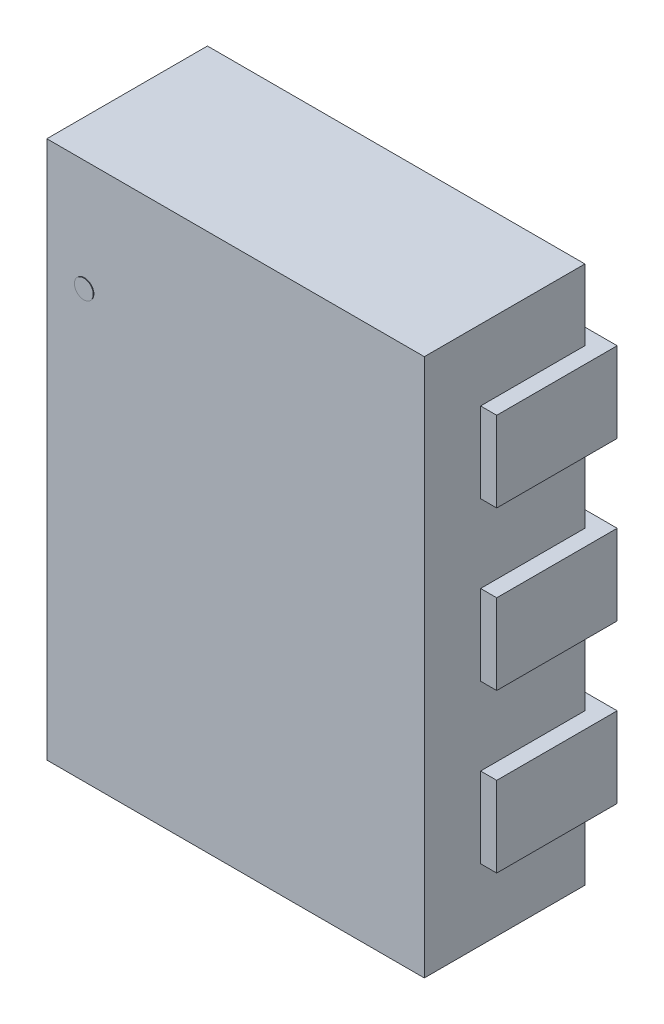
ISO-10303-21;
HEADER;
FILE_DESCRIPTION(('STEP AP214'),'2;1');
FILE_NAME('part.step','',(''),(''),'','','');
FILE_SCHEMA(('AUTOMOTIVE_DESIGN { 1 0 10303 214 1 1 1 1 }'));
ENDSEC;
DATA;
#1=APPLICATION_CONTEXT('core data for automotive mechanical design processes');
#2=APPLICATION_PROTOCOL_DEFINITION('international standard','automotive_design',2000,#1);
#3=PRODUCT_CONTEXT('',#1,'mechanical');
#4=PRODUCT('Part','Part','',(#3));
#5=PRODUCT_RELATED_PRODUCT_CATEGORY('part','',(#4));
#6=PRODUCT_DEFINITION_FORMATION('','',#4);
#7=PRODUCT_DEFINITION_CONTEXT('part definition',#1,'design');
#8=PRODUCT_DEFINITION('design','',#6,#7);
#9=PRODUCT_DEFINITION_SHAPE('','',#8);
#10=(LENGTH_UNIT() NAMED_UNIT(*) SI_UNIT(.MILLI.,.METRE.));
#11=(NAMED_UNIT(*) PLANE_ANGLE_UNIT() SI_UNIT($,.RADIAN.));
#12=(NAMED_UNIT(*) SI_UNIT($,.STERADIAN.) SOLID_ANGLE_UNIT());
#13=UNCERTAINTY_MEASURE_WITH_UNIT(LENGTH_MEASURE(1.E-05),#10,'distance_accuracy_value','');
#14=(GEOMETRIC_REPRESENTATION_CONTEXT(3) GLOBAL_UNCERTAINTY_ASSIGNED_CONTEXT((#13)) GLOBAL_UNIT_ASSIGNED_CONTEXT((#10,
#11,#12)) REPRESENTATION_CONTEXT('',''));
#15=CARTESIAN_POINT('',(0.,0.,0.));
#16=DIRECTION('',(0.,0.,1.));
#17=DIRECTION('',(1.,0.,0.));
#18=AXIS2_PLACEMENT_3D('',#15,#16,#17);
#19=CARTESIAN_POINT('',(-0.478,0.5,0.561));
#20=DIRECTION('',(0.,0.,1.));
#21=DIRECTION('',(1.,0.,0.));
#22=AXIS2_PLACEMENT_3D('',#19,#20,#21);
#23=PLANE('',#22);
#24=CARTESIAN_POINT('',(-0.478,0.5,0.561));
#25=DIRECTION('',(0.,0.,1.));
#26=DIRECTION('',(1.,0.,0.));
#27=AXIS2_PLACEMENT_3D('',#24,#25,#26);
#28=CIRCLE('',#27,0.029845);
#29=CARTESIAN_POINT('',(-0.507,0.5,0.561));
#30=VERTEX_POINT('',#29);
#31=EDGE_CURVE('P0_E44',#30,#30,#28,.T.);
#32=ORIENTED_EDGE('',*,*,#31,.T.);
#33=EDGE_LOOP('',(#32));
#34=FACE_BOUND('',#33,.T.);
#35=ADVANCED_FACE('P0_F17',(#34),#23,.T.);
#36=CARTESIAN_POINT('',(-0.478,0.5,0.559));
#37=DIRECTION('',(0.,0.,1.));
#38=DIRECTION('',(1.,0.,0.));
#39=AXIS2_PLACEMENT_3D('',#36,#37,#38);
#40=PLANE('',#39);
#41=CARTESIAN_POINT('',(-0.478,0.5,0.559));
#42=DIRECTION('',(0.,0.,-1.));
#43=DIRECTION('',(1.,0.,0.));
#44=AXIS2_PLACEMENT_3D('',#41,#42,#43);
#45=CIRCLE('',#44,0.029845);
#46=CARTESIAN_POINT('',(-0.507,0.5,0.559));
#47=VERTEX_POINT('',#46);
#48=EDGE_CURVE('P0_E11',#47,#47,#45,.T.);
#49=ORIENTED_EDGE('',*,*,#48,.T.);
#50=EDGE_LOOP('',(#49));
#51=FACE_BOUND('',#50,.T.);
#52=ADVANCED_FACE('P0_F69',(#51),#40,.F.);
#53=CARTESIAN_POINT('',(-0.478,0.5,0.559));
#54=DIRECTION('',(0.,0.,1.));
#55=DIRECTION('',(1.,0.,0.));
#56=AXIS2_PLACEMENT_3D('',#53,#54,#55);
#57=CYLINDRICAL_SURFACE('',#56,0.029845);
#58=ORIENTED_EDGE('',*,*,#31,.F.);
#59=CARTESIAN_POINT('',(-0.507845,0.5,0.559));
#60=CARTESIAN_POINT('',(-0.507845,0.5,0.561));
#61=(BOUNDED_CURVE() B_SPLINE_CURVE(1,(#59,#60),.UNSPECIFIED.,.F.,
.F.) B_SPLINE_CURVE_WITH_KNOTS((2,2),(0.,0.002),
.UNSPECIFIED.) CURVE() GEOMETRIC_REPRESENTATION_ITEM() RATIONAL_B_SPLINE_CURVE((1.,1.)) REPRESENTATION_ITEM(''));
#62=EDGE_CURVE('P0_E27',#47,#30,#61,.T.);
#63=ORIENTED_EDGE('',*,*,#62,.F.);
#64=ORIENTED_EDGE('',*,*,#48,.F.);
#65=ORIENTED_EDGE('',*,*,#62,.T.);
#66=EDGE_LOOP('',(#58,#63,#64,#65));
#67=FACE_BOUND('',#66,.T.);
#68=ADVANCED_FACE('P0_F43',(#67),#57,.T.);
#69=CLOSED_SHELL('',(#35,#52,#68));
#70=MANIFOLD_SOLID_BREP('P0_B1',#69);
#71=CARTESIAN_POINT('',(-0.597,-0.851,0.559));
#72=DIRECTION('',(0.,0.,1.));
#73=DIRECTION('',(1.,0.,0.));
#74=AXIS2_PLACEMENT_3D('',#71,#72,#73);
#75=PLANE('',#74);
#76=DIRECTION('',(1.,0.,0.));
#77=VECTOR('',#76,1.);
#78=CARTESIAN_POINT('',(-0.597,-0.851,0.559));
#79=LINE('',#78,#77);
#80=CARTESIAN_POINT('',(-0.597,-0.851,0.559));
#81=VERTEX_POINT('',#80);
#82=CARTESIAN_POINT('',(0.597,-0.851,0.559));
#83=VERTEX_POINT('',#82);
#84=EDGE_CURVE('P1_E91',#81,#83,#79,.T.);
#85=ORIENTED_EDGE('',*,*,#84,.T.);
#86=DIRECTION('',(0.,1.,0.));
#87=VECTOR('',#86,1.);
#88=CARTESIAN_POINT('',(0.597,-0.851,0.559));
#89=LINE('',#88,#87);
#90=CARTESIAN_POINT('',(0.597,0.851,0.559));
#91=VERTEX_POINT('',#90);
#92=EDGE_CURVE('P1_E86',#83,#91,#89,.T.);
#93=ORIENTED_EDGE('',*,*,#92,.T.);
#94=DIRECTION('',(-1.,0.,0.));
#95=VECTOR('',#94,1.);
#96=CARTESIAN_POINT('',(0.597,0.851,0.559));
#97=LINE('',#96,#95);
#98=CARTESIAN_POINT('',(-0.597,0.851,0.559));
#99=VERTEX_POINT('',#98);
#100=EDGE_CURVE('P1_E111',#91,#99,#97,.T.);
#101=ORIENTED_EDGE('',*,*,#100,.T.);
#102=DIRECTION('',(0.,-1.,0.));
#103=VECTOR('',#102,1.);
#104=CARTESIAN_POINT('',(-0.597,0.851,0.559));
#105=LINE('',#104,#103);
#106=EDGE_CURVE('P1_E11',#99,#81,#105,.T.);
#107=ORIENTED_EDGE('',*,*,#106,.T.);
#108=EDGE_LOOP('',(#85,#93,#101,#107));
#109=FACE_BOUND('',#108,.T.);
#110=ADVANCED_FACE('P1_F17',(#109),#75,.T.);
#111=CARTESIAN_POINT('',(-0.597,0.851,0.051));
#112=DIRECTION('',(0.,0.,-1.));
#113=DIRECTION('',(0.,-1.,0.));
#114=AXIS2_PLACEMENT_3D('',#111,#112,#113);
#115=PLANE('',#114);
#116=DIRECTION('',(1.,0.,0.));
#117=VECTOR('',#116,1.);
#118=CARTESIAN_POINT('',(-0.597,0.851,0.051));
#119=LINE('',#118,#117);
#120=CARTESIAN_POINT('',(-0.597,0.851,0.051));
#121=VERTEX_POINT('',#120);
#122=CARTESIAN_POINT('',(0.597,0.851,0.051));
#123=VERTEX_POINT('',#122);
#124=EDGE_CURVE('P1_E74',#121,#123,#119,.T.);
#125=ORIENTED_EDGE('',*,*,#124,.T.);
#126=DIRECTION('',(0.,-1.,0.));
#127=VECTOR('',#126,1.);
#128=CARTESIAN_POINT('',(0.597,0.851,0.051));
#129=LINE('',#128,#127);
#130=CARTESIAN_POINT('',(0.597,-0.851,0.051));
#131=VERTEX_POINT('',#130);
#132=EDGE_CURVE('P1_E68',#123,#131,#129,.T.);
#133=ORIENTED_EDGE('',*,*,#132,.T.);
#134=DIRECTION('',(-1.,0.,0.));
#135=VECTOR('',#134,1.);
#136=CARTESIAN_POINT('',(0.597,-0.851,0.051));
#137=LINE('',#136,#135);
#138=CARTESIAN_POINT('',(-0.597,-0.851,0.051));
#139=VERTEX_POINT('',#138);
#140=EDGE_CURVE('P1_E72',#131,#139,#137,.T.);
#141=ORIENTED_EDGE('',*,*,#140,.T.);
#142=DIRECTION('',(0.,1.,0.));
#143=VECTOR('',#142,1.);
#144=CARTESIAN_POINT('',(-0.597,-0.851,0.051));
#145=LINE('',#144,#143);
#146=EDGE_CURVE('P1_E20',#139,#121,#145,.T.);
#147=ORIENTED_EDGE('',*,*,#146,.T.);
#148=EDGE_LOOP('',(#125,#133,#141,#147));
#149=FACE_BOUND('',#148,.T.);
#150=ADVANCED_FACE('P1_F70',(#149),#115,.T.);
#151=CARTESIAN_POINT('',(-0.597,0.851,0.051));
#152=DIRECTION('',(-1.,0.,0.));
#153=DIRECTION('',(0.,0.,1.));
#154=AXIS2_PLACEMENT_3D('',#151,#152,#153);
#155=PLANE('',#154);
#156=ORIENTED_EDGE('',*,*,#146,.F.);
#157=DIRECTION('',(0.,0.,1.));
#158=VECTOR('',#157,1.);
#159=CARTESIAN_POINT('',(-0.597,-0.851,0.051));
#160=LINE('',#159,#158);
#161=EDGE_CURVE('P1_E80',#139,#81,#160,.T.);
#162=ORIENTED_EDGE('',*,*,#161,.T.);
#163=ORIENTED_EDGE('',*,*,#106,.F.);
#164=DIRECTION('',(0.,0.,-1.));
#165=VECTOR('',#164,1.);
#166=CARTESIAN_POINT('',(-0.597,0.851,0.559));
#167=LINE('',#166,#165);
#168=EDGE_CURVE('P1_E109',#99,#121,#167,.T.);
#169=ORIENTED_EDGE('',*,*,#168,.T.);
#170=EDGE_LOOP('',(#156,#162,#163,#169));
#171=FACE_BOUND('',#170,.T.);
#172=ADVANCED_FACE('P1_F148',(#171),#155,.T.);
#173=CARTESIAN_POINT('',(0.597,0.851,0.051));
#174=DIRECTION('',(0.,1.,0.));
#175=DIRECTION('',(1.,0.,0.));
#176=AXIS2_PLACEMENT_3D('',#173,#174,#175);
#177=PLANE('',#176);
#178=ORIENTED_EDGE('',*,*,#124,.F.);
#179=ORIENTED_EDGE('',*,*,#168,.F.);
#180=ORIENTED_EDGE('',*,*,#100,.F.);
#181=DIRECTION('',(0.,0.,-1.));
#182=VECTOR('',#181,1.);
#183=CARTESIAN_POINT('',(0.597,0.851,0.559));
#184=LINE('',#183,#182);
#185=EDGE_CURVE('P1_E79',#91,#123,#184,.T.);
#186=ORIENTED_EDGE('',*,*,#185,.T.);
#187=EDGE_LOOP('',(#178,#179,#180,#186));
#188=FACE_BOUND('',#187,.T.);
#189=ADVANCED_FACE('P1_F138',(#188),#177,.T.);
#190=CARTESIAN_POINT('',(0.597,-0.851,0.051));
#191=DIRECTION('',(1.,0.,0.));
#192=DIRECTION('',(0.,1.,0.));
#193=AXIS2_PLACEMENT_3D('',#190,#191,#192);
#194=PLANE('',#193);
#195=ORIENTED_EDGE('',*,*,#132,.F.);
#196=ORIENTED_EDGE('',*,*,#185,.F.);
#197=ORIENTED_EDGE('',*,*,#92,.F.);
#198=DIRECTION('',(0.,0.,-1.));
#199=VECTOR('',#198,1.);
#200=CARTESIAN_POINT('',(0.597,-0.851,0.559));
#201=LINE('',#200,#199);
#202=EDGE_CURVE('P1_E83',#83,#131,#201,.T.);
#203=ORIENTED_EDGE('',*,*,#202,.T.);
#204=EDGE_LOOP('',(#195,#196,#197,#203));
#205=FACE_BOUND('',#204,.T.);
#206=ADVANCED_FACE('P1_F84',(#205),#194,.T.);
#207=CARTESIAN_POINT('',(-0.597,-0.851,0.051));
#208=DIRECTION('',(0.,-1.,0.));
#209=DIRECTION('',(0.,0.,-1.));
#210=AXIS2_PLACEMENT_3D('',#207,#208,#209);
#211=PLANE('',#210);
#212=ORIENTED_EDGE('',*,*,#140,.F.);
#213=ORIENTED_EDGE('',*,*,#202,.F.);
#214=ORIENTED_EDGE('',*,*,#84,.F.);
#215=ORIENTED_EDGE('',*,*,#161,.F.);
#216=EDGE_LOOP('',(#212,#213,#214,#215));
#217=FACE_BOUND('',#216,.T.);
#218=ADVANCED_FACE('P1_F94',(#217),#211,.T.);
#219=CLOSED_SHELL('',(#110,#150,#172,#189,#206,#218));
#220=MANIFOLD_SOLID_BREP('P1_B1',#219);
#221=CARTESIAN_POINT('',(0.648,-0.627,0.));
#222=DIRECTION('',(0.,0.,-1.));
#223=DIRECTION('',(0.,-1.,0.));
#224=AXIS2_PLACEMENT_3D('',#221,#222,#223);
#225=PLANE('',#224);
#226=DIRECTION('',(-1.,0.,0.));
#227=VECTOR('',#226,1.);
#228=CARTESIAN_POINT('',(0.648,-0.627,0.));
#229=LINE('',#228,#227);
#230=CARTESIAN_POINT('',(0.648,-0.627,0.));
#231=VERTEX_POINT('',#230);
#232=CARTESIAN_POINT('',(0.244,-0.627,0.));
#233=VERTEX_POINT('',#232);
#234=EDGE_CURVE('P2_E110',#231,#233,#229,.T.);
#235=ORIENTED_EDGE('',*,*,#234,.T.);
#236=DIRECTION('',(0.,1.,0.));
#237=VECTOR('',#236,1.);
#238=CARTESIAN_POINT('',(0.244,-0.627,0.));
#239=LINE('',#238,#237);
#240=CARTESIAN_POINT('',(0.244,-0.373,0.));
#241=VERTEX_POINT('',#240);
#242=EDGE_CURVE('P2_E11',#233,#241,#239,.T.);
#243=ORIENTED_EDGE('',*,*,#242,.T.);
#244=DIRECTION('',(1.,0.,0.));
#245=VECTOR('',#244,1.);
#246=CARTESIAN_POINT('',(0.244,-0.373,0.));
#247=LINE('',#246,#245);
#248=CARTESIAN_POINT('',(0.648,-0.373,0.));
#249=VERTEX_POINT('',#248);
#250=EDGE_CURVE('P2_E137',#241,#249,#247,.T.);
#251=ORIENTED_EDGE('',*,*,#250,.T.);
#252=DIRECTION('',(0.,-1.,0.));
#253=VECTOR('',#252,1.);
#254=CARTESIAN_POINT('',(0.648,-0.373,0.));
#255=LINE('',#254,#253);
#256=EDGE_CURVE('P2_E26',#249,#231,#255,.T.);
#257=ORIENTED_EDGE('',*,*,#256,.T.);
#258=EDGE_LOOP('',(#235,#243,#251,#257));
#259=FACE_BOUND('',#258,.T.);
#260=ADVANCED_FACE('P2_F17',(#259),#225,.T.);
#261=CARTESIAN_POINT('',(0.597,-0.373,0.051));
#262=DIRECTION('',(-1.,0.,0.));
#263=DIRECTION('',(0.,0.,1.));
#264=AXIS2_PLACEMENT_3D('',#261,#262,#263);
#265=PLANE('',#264);
#266=DIRECTION('',(0.,-1.,0.));
#267=VECTOR('',#266,1.);
#268=CARTESIAN_POINT('',(0.597,-0.373,0.051));
#269=LINE('',#268,#267);
#270=CARTESIAN_POINT('',(0.597,-0.373,0.051));
#271=VERTEX_POINT('',#270);
#272=CARTESIAN_POINT('',(0.597,-0.627,0.051));
#273=VERTEX_POINT('',#272);
#274=EDGE_CURVE('P2_E94',#271,#273,#269,.T.);
#275=ORIENTED_EDGE('',*,*,#274,.T.);
#276=DIRECTION('',(0.,0.,1.));
#277=VECTOR('',#276,1.);
#278=CARTESIAN_POINT('',(0.597,-0.627,0.051));
#279=LINE('',#278,#277);
#280=CARTESIAN_POINT('',(0.597,-0.627,0.381));
#281=VERTEX_POINT('',#280);
#282=EDGE_CURVE('P2_E92',#273,#281,#279,.T.);
#283=ORIENTED_EDGE('',*,*,#282,.T.);
#284=DIRECTION('',(0.,1.,0.));
#285=VECTOR('',#284,1.);
#286=CARTESIAN_POINT('',(0.597,-0.627,0.381));
#287=LINE('',#286,#285);
#288=CARTESIAN_POINT('',(0.597,-0.373,0.381));
#289=VERTEX_POINT('',#288);
#290=EDGE_CURVE('P2_E76',#281,#289,#287,.T.);
#291=ORIENTED_EDGE('',*,*,#290,.T.);
#292=DIRECTION('',(0.,0.,-1.));
#293=VECTOR('',#292,1.);
#294=CARTESIAN_POINT('',(0.597,-0.373,0.381));
#295=LINE('',#294,#293);
#296=EDGE_CURVE('P2_E115',#289,#271,#295,.T.);
#297=ORIENTED_EDGE('',*,*,#296,.T.);
#298=EDGE_LOOP('',(#275,#283,#291,#297));
#299=FACE_BOUND('',#298,.T.);
#300=ADVANCED_FACE('P2_F93',(#299),#265,.T.);
#301=CARTESIAN_POINT('',(0.244,-0.373,0.));
#302=DIRECTION('',(-1.,0.,0.));
#303=DIRECTION('',(0.,0.,1.));
#304=AXIS2_PLACEMENT_3D('',#301,#302,#303);
#305=PLANE('',#304);
#306=ORIENTED_EDGE('',*,*,#242,.F.);
#307=DIRECTION('',(0.,0.,1.));
#308=VECTOR('',#307,1.);
#309=CARTESIAN_POINT('',(0.244,-0.627,0.));
#310=LINE('',#309,#308);
#311=CARTESIAN_POINT('',(0.244,-0.627,0.051));
#312=VERTEX_POINT('',#311);
#313=EDGE_CURVE('P2_E89',#233,#312,#310,.T.);
#314=ORIENTED_EDGE('',*,*,#313,.T.);
#315=DIRECTION('',(0.,1.,0.));
#316=VECTOR('',#315,1.);
#317=CARTESIAN_POINT('',(0.244,-0.627,0.051));
#318=LINE('',#317,#316);
#319=CARTESIAN_POINT('',(0.244,-0.373,0.051));
#320=VERTEX_POINT('',#319);
#321=EDGE_CURVE('P2_E38',#312,#320,#318,.T.);
#322=ORIENTED_EDGE('',*,*,#321,.T.);
#323=DIRECTION('',(0.,0.,-1.));
#324=VECTOR('',#323,1.);
#325=CARTESIAN_POINT('',(0.244,-0.373,0.051));
#326=LINE('',#325,#324);
#327=EDGE_CURVE('P2_E150',#320,#241,#326,.T.);
#328=ORIENTED_EDGE('',*,*,#327,.T.);
#329=EDGE_LOOP('',(#306,#314,#322,#328));
#330=FACE_BOUND('',#329,.T.);
#331=ADVANCED_FACE('P2_F161',(#330),#305,.T.);
#332=CARTESIAN_POINT('',(0.648,-0.627,0.));
#333=DIRECTION('',(1.,0.,0.));
#334=DIRECTION('',(0.,1.,0.));
#335=AXIS2_PLACEMENT_3D('',#332,#333,#334);
#336=PLANE('',#335);
#337=ORIENTED_EDGE('',*,*,#256,.F.);
#338=DIRECTION('',(0.,0.,1.));
#339=VECTOR('',#338,1.);
#340=CARTESIAN_POINT('',(0.648,-0.373,0.));
#341=LINE('',#340,#339);
#342=CARTESIAN_POINT('',(0.648,-0.373,0.381));
#343=VERTEX_POINT('',#342);
#344=EDGE_CURVE('P2_E119',#249,#343,#341,.T.);
#345=ORIENTED_EDGE('',*,*,#344,.T.);
#346=DIRECTION('',(0.,-1.,0.));
#347=VECTOR('',#346,1.);
#348=CARTESIAN_POINT('',(0.648,-0.373,0.381));
#349=LINE('',#348,#347);
#350=CARTESIAN_POINT('',(0.648,-0.627,0.381));
#351=VERTEX_POINT('',#350);
#352=EDGE_CURVE('P2_E88',#343,#351,#349,.T.);
#353=ORIENTED_EDGE('',*,*,#352,.T.);
#354=DIRECTION('',(0.,0.,-1.));
#355=VECTOR('',#354,1.);
#356=CARTESIAN_POINT('',(0.648,-0.627,0.381));
#357=LINE('',#356,#355);
#358=EDGE_CURVE('P2_E103',#351,#231,#357,.T.);
#359=ORIENTED_EDGE('',*,*,#358,.T.);
#360=EDGE_LOOP('',(#337,#345,#353,#359));
#361=FACE_BOUND('',#360,.T.);
#362=ADVANCED_FACE('P2_F140',(#361),#336,.T.);
#363=CARTESIAN_POINT('',(0.597,-0.373,0.051));
#364=DIRECTION('',(0.,0.,1.));
#365=DIRECTION('',(1.,0.,0.));
#366=AXIS2_PLACEMENT_3D('',#363,#364,#365);
#367=PLANE('',#366);
#368=DIRECTION('',(-1.,0.,0.));
#369=VECTOR('',#368,1.);
#370=CARTESIAN_POINT('',(0.597,-0.373,0.051));
#371=LINE('',#370,#369);
#372=EDGE_CURVE('P2_E114',#271,#320,#371,.T.);
#373=ORIENTED_EDGE('',*,*,#372,.T.);
#374=ORIENTED_EDGE('',*,*,#321,.F.);
#375=DIRECTION('',(1.,0.,0.));
#376=VECTOR('',#375,1.);
#377=CARTESIAN_POINT('',(0.244,-0.627,0.051));
#378=LINE('',#377,#376);
#379=EDGE_CURVE('P2_E98',#312,#273,#378,.T.);
#380=ORIENTED_EDGE('',*,*,#379,.T.);
#381=ORIENTED_EDGE('',*,*,#274,.F.);
#382=EDGE_LOOP('',(#373,#374,#380,#381));
#383=FACE_BOUND('',#382,.T.);
#384=ADVANCED_FACE('P2_F162',(#383),#367,.T.);
#385=CARTESIAN_POINT('',(0.648,-0.373,0.381));
#386=DIRECTION('',(0.,0.,1.));
#387=DIRECTION('',(1.,0.,0.));
#388=AXIS2_PLACEMENT_3D('',#385,#386,#387);
#389=PLANE('',#388);
#390=DIRECTION('',(-1.,0.,0.));
#391=VECTOR('',#390,1.);
#392=CARTESIAN_POINT('',(0.648,-0.373,0.381));
#393=LINE('',#392,#391);
#394=EDGE_CURVE('P2_E83',#343,#289,#393,.T.);
#395=ORIENTED_EDGE('',*,*,#394,.T.);
#396=ORIENTED_EDGE('',*,*,#290,.F.);
#397=DIRECTION('',(1.,0.,0.));
#398=VECTOR('',#397,1.);
#399=CARTESIAN_POINT('',(0.597,-0.627,0.381));
#400=LINE('',#399,#398);
#401=EDGE_CURVE('P2_E80',#281,#351,#400,.T.);
#402=ORIENTED_EDGE('',*,*,#401,.T.);
#403=ORIENTED_EDGE('',*,*,#352,.F.);
#404=EDGE_LOOP('',(#395,#396,#402,#403));
#405=FACE_BOUND('',#404,.T.);
#406=ADVANCED_FACE('P2_F78',(#405),#389,.T.);
#407=CARTESIAN_POINT('',(0.244,-0.627,0.));
#408=DIRECTION('',(0.,-1.,0.));
#409=DIRECTION('',(0.,0.,-1.));
#410=AXIS2_PLACEMENT_3D('',#407,#408,#409);
#411=PLANE('',#410);
#412=ORIENTED_EDGE('',*,*,#234,.F.);
#413=ORIENTED_EDGE('',*,*,#358,.F.);
#414=ORIENTED_EDGE('',*,*,#401,.F.);
#415=ORIENTED_EDGE('',*,*,#282,.F.);
#416=ORIENTED_EDGE('',*,*,#379,.F.);
#417=ORIENTED_EDGE('',*,*,#313,.F.);
#418=EDGE_LOOP('',(#412,#413,#414,#415,#416,#417));
#419=FACE_BOUND('',#418,.T.);
#420=ADVANCED_FACE('P2_F101',(#419),#411,.T.);
#421=CARTESIAN_POINT('',(0.648,-0.373,0.));
#422=DIRECTION('',(0.,1.,0.));
#423=DIRECTION('',(1.,0.,0.));
#424=AXIS2_PLACEMENT_3D('',#421,#422,#423);
#425=PLANE('',#424);
#426=ORIENTED_EDGE('',*,*,#250,.F.);
#427=ORIENTED_EDGE('',*,*,#327,.F.);
#428=ORIENTED_EDGE('',*,*,#372,.F.);
#429=ORIENTED_EDGE('',*,*,#296,.F.);
#430=ORIENTED_EDGE('',*,*,#394,.F.);
#431=ORIENTED_EDGE('',*,*,#344,.F.);
#432=EDGE_LOOP('',(#426,#427,#428,#429,#430,#431));
#433=FACE_BOUND('',#432,.T.);
#434=ADVANCED_FACE('P2_F165',(#433),#425,.T.);
#435=CLOSED_SHELL('',(#260,#300,#331,#362,#384,#406,#420,#434));
#436=MANIFOLD_SOLID_BREP('P2_B1',#435);
#437=CARTESIAN_POINT('',(0.648,-0.127,0.));
#438=DIRECTION('',(0.,0.,-1.));
#439=DIRECTION('',(0.,-1.,0.));
#440=AXIS2_PLACEMENT_3D('',#437,#438,#439);
#441=PLANE('',#440);
#442=DIRECTION('',(-1.,0.,0.));
#443=VECTOR('',#442,1.);
#444=CARTESIAN_POINT('',(0.648,-0.127,0.));
#445=LINE('',#444,#443);
#446=CARTESIAN_POINT('',(0.648,-0.127,0.));
#447=VERTEX_POINT('',#446);
#448=CARTESIAN_POINT('',(0.244,-0.127,0.));
#449=VERTEX_POINT('',#448);
#450=EDGE_CURVE('P3_E93',#447,#449,#445,.T.);
#451=ORIENTED_EDGE('',*,*,#450,.T.);
#452=DIRECTION('',(0.,1.,0.));
#453=VECTOR('',#452,1.);
#454=CARTESIAN_POINT('',(0.244,-0.127,0.));
#455=LINE('',#454,#453);
#456=CARTESIAN_POINT('',(0.244,0.127,0.));
#457=VERTEX_POINT('',#456);
#458=EDGE_CURVE('P3_E11',#449,#457,#455,.T.);
#459=ORIENTED_EDGE('',*,*,#458,.T.);
#460=DIRECTION('',(1.,0.,0.));
#461=VECTOR('',#460,1.);
#462=CARTESIAN_POINT('',(0.244,0.127,0.));
#463=LINE('',#462,#461);
#464=CARTESIAN_POINT('',(0.648,0.127,0.));
#465=VERTEX_POINT('',#464);
#466=EDGE_CURVE('P3_E91',#457,#465,#463,.T.);
#467=ORIENTED_EDGE('',*,*,#466,.T.);
#468=DIRECTION('',(0.,-1.,0.));
#469=VECTOR('',#468,1.);
#470=CARTESIAN_POINT('',(0.648,0.127,0.));
#471=LINE('',#470,#469);
#472=EDGE_CURVE('P3_E26',#465,#447,#471,.T.);
#473=ORIENTED_EDGE('',*,*,#472,.T.);
#474=EDGE_LOOP('',(#451,#459,#467,#473));
#475=FACE_BOUND('',#474,.T.);
#476=ADVANCED_FACE('P3_F17',(#475),#441,.T.);
#477=CARTESIAN_POINT('',(0.597,0.127,0.051));
#478=DIRECTION('',(-1.,0.,0.));
#479=DIRECTION('',(0.,0.,1.));
#480=AXIS2_PLACEMENT_3D('',#477,#478,#479);
#481=PLANE('',#480);
#482=DIRECTION('',(0.,-1.,0.));
#483=VECTOR('',#482,1.);
#484=CARTESIAN_POINT('',(0.597,0.127,0.051));
#485=LINE('',#484,#483);
#486=CARTESIAN_POINT('',(0.597,0.127,0.051));
#487=VERTEX_POINT('',#486);
#488=CARTESIAN_POINT('',(0.597,-0.127,0.051));
#489=VERTEX_POINT('',#488);
#490=EDGE_CURVE('P3_E48',#487,#489,#485,.T.);
#491=ORIENTED_EDGE('',*,*,#490,.T.);
#492=DIRECTION('',(0.,0.,1.));
#493=VECTOR('',#492,1.);
#494=CARTESIAN_POINT('',(0.597,-0.127,0.051));
#495=LINE('',#494,#493);
#496=CARTESIAN_POINT('',(0.597,-0.127,0.381));
#497=VERTEX_POINT('',#496);
#498=EDGE_CURVE('P3_E134',#489,#497,#495,.T.);
#499=ORIENTED_EDGE('',*,*,#498,.T.);
#500=DIRECTION('',(0.,1.,0.));
#501=VECTOR('',#500,1.);
#502=CARTESIAN_POINT('',(0.597,-0.127,0.381));
#503=LINE('',#502,#501);
#504=CARTESIAN_POINT('',(0.597,0.127,0.381));
#505=VERTEX_POINT('',#504);
#506=EDGE_CURVE('P3_E118',#497,#505,#503,.T.);
#507=ORIENTED_EDGE('',*,*,#506,.T.);
#508=DIRECTION('',(0.,0.,-1.));
#509=VECTOR('',#508,1.);
#510=CARTESIAN_POINT('',(0.597,0.127,0.381));
#511=LINE('',#510,#509);
#512=EDGE_CURVE('P3_E127',#505,#487,#511,.T.);
#513=ORIENTED_EDGE('',*,*,#512,.T.);
#514=EDGE_LOOP('',(#491,#499,#507,#513));
#515=FACE_BOUND('',#514,.T.);
#516=ADVANCED_FACE('P3_F19',(#515),#481,.T.);
#517=CARTESIAN_POINT('',(0.244,0.127,0.));
#518=DIRECTION('',(-1.,0.,0.));
#519=DIRECTION('',(0.,0.,1.));
#520=AXIS2_PLACEMENT_3D('',#517,#518,#519);
#521=PLANE('',#520);
#522=ORIENTED_EDGE('',*,*,#458,.F.);
#523=DIRECTION('',(0.,0.,1.));
#524=VECTOR('',#523,1.);
#525=CARTESIAN_POINT('',(0.244,-0.127,0.));
#526=LINE('',#525,#524);
#527=CARTESIAN_POINT('',(0.244,-0.127,0.051));
#528=VERTEX_POINT('',#527);
#529=EDGE_CURVE('P3_E115',#449,#528,#526,.T.);
#530=ORIENTED_EDGE('',*,*,#529,.T.);
#531=DIRECTION('',(0.,1.,0.));
#532=VECTOR('',#531,1.);
#533=CARTESIAN_POINT('',(0.244,-0.127,0.051));
#534=LINE('',#533,#532);
#535=CARTESIAN_POINT('',(0.244,0.127,0.051));
#536=VERTEX_POINT('',#535);
#537=EDGE_CURVE('P3_E38',#528,#536,#534,.T.);
#538=ORIENTED_EDGE('',*,*,#537,.T.);
#539=DIRECTION('',(0.,0.,-1.));
#540=VECTOR('',#539,1.);
#541=CARTESIAN_POINT('',(0.244,0.127,0.051));
#542=LINE('',#541,#540);
#543=EDGE_CURVE('P3_E97',#536,#457,#542,.T.);
#544=ORIENTED_EDGE('',*,*,#543,.T.);
#545=EDGE_LOOP('',(#522,#530,#538,#544));
#546=FACE_BOUND('',#545,.T.);
#547=ADVANCED_FACE('P3_F98',(#546),#521,.T.);
#548=CARTESIAN_POINT('',(0.648,-0.127,0.));
#549=DIRECTION('',(1.,0.,0.));
#550=DIRECTION('',(0.,1.,0.));
#551=AXIS2_PLACEMENT_3D('',#548,#549,#550);
#552=PLANE('',#551);
#553=ORIENTED_EDGE('',*,*,#472,.F.);
#554=DIRECTION('',(0.,0.,1.));
#555=VECTOR('',#554,1.);
#556=CARTESIAN_POINT('',(0.648,0.127,0.));
#557=LINE('',#556,#555);
#558=CARTESIAN_POINT('',(0.648,0.127,0.381));
#559=VERTEX_POINT('',#558);
#560=EDGE_CURVE('P3_E108',#465,#559,#557,.T.);
#561=ORIENTED_EDGE('',*,*,#560,.T.);
#562=DIRECTION('',(0.,-1.,0.));
#563=VECTOR('',#562,1.);
#564=CARTESIAN_POINT('',(0.648,0.127,0.381));
#565=LINE('',#564,#563);
#566=CARTESIAN_POINT('',(0.648,-0.127,0.381));
#567=VERTEX_POINT('',#566);
#568=EDGE_CURVE('P3_E140',#559,#567,#565,.T.);
#569=ORIENTED_EDGE('',*,*,#568,.T.);
#570=DIRECTION('',(0.,0.,-1.));
#571=VECTOR('',#570,1.);
#572=CARTESIAN_POINT('',(0.648,-0.127,0.381));
#573=LINE('',#572,#571);
#574=EDGE_CURVE('P3_E120',#567,#447,#573,.T.);
#575=ORIENTED_EDGE('',*,*,#574,.T.);
#576=EDGE_LOOP('',(#553,#561,#569,#575));
#577=FACE_BOUND('',#576,.T.);
#578=ADVANCED_FACE('P3_F156',(#577),#552,.T.);
#579=CARTESIAN_POINT('',(0.597,0.127,0.051));
#580=DIRECTION('',(0.,0.,1.));
#581=DIRECTION('',(1.,0.,0.));
#582=AXIS2_PLACEMENT_3D('',#579,#580,#581);
#583=PLANE('',#582);
#584=DIRECTION('',(-1.,0.,0.));
#585=VECTOR('',#584,1.);
#586=CARTESIAN_POINT('',(0.597,0.127,0.051));
#587=LINE('',#586,#585);
#588=EDGE_CURVE('P3_E102',#487,#536,#587,.T.);
#589=ORIENTED_EDGE('',*,*,#588,.T.);
#590=ORIENTED_EDGE('',*,*,#537,.F.);
#591=DIRECTION('',(1.,0.,0.));
#592=VECTOR('',#591,1.);
#593=CARTESIAN_POINT('',(0.244,-0.127,0.051));
#594=LINE('',#593,#592);
#595=EDGE_CURVE('P3_E119',#528,#489,#594,.T.);
#596=ORIENTED_EDGE('',*,*,#595,.T.);
#597=ORIENTED_EDGE('',*,*,#490,.F.);
#598=EDGE_LOOP('',(#589,#590,#596,#597));
#599=FACE_BOUND('',#598,.T.);
#600=ADVANCED_FACE('P3_F162',(#599),#583,.T.);
#601=CARTESIAN_POINT('',(0.648,0.127,0.381));
#602=DIRECTION('',(0.,0.,1.));
#603=DIRECTION('',(1.,0.,0.));
#604=AXIS2_PLACEMENT_3D('',#601,#602,#603);
#605=PLANE('',#604);
#606=DIRECTION('',(-1.,0.,0.));
#607=VECTOR('',#606,1.);
#608=CARTESIAN_POINT('',(0.648,0.127,0.381));
#609=LINE('',#608,#607);
#610=EDGE_CURVE('P3_E130',#559,#505,#609,.T.);
#611=ORIENTED_EDGE('',*,*,#610,.T.);
#612=ORIENTED_EDGE('',*,*,#506,.F.);
#613=DIRECTION('',(1.,0.,0.));
#614=VECTOR('',#613,1.);
#615=CARTESIAN_POINT('',(0.597,-0.127,0.381));
#616=LINE('',#615,#614);
#617=EDGE_CURVE('P3_E124',#497,#567,#616,.T.);
#618=ORIENTED_EDGE('',*,*,#617,.T.);
#619=ORIENTED_EDGE('',*,*,#568,.F.);
#620=EDGE_LOOP('',(#611,#612,#618,#619));
#621=FACE_BOUND('',#620,.T.);
#622=ADVANCED_FACE('P3_F165',(#621),#605,.T.);
#623=CARTESIAN_POINT('',(0.244,-0.127,0.));
#624=DIRECTION('',(0.,-1.,0.));
#625=DIRECTION('',(0.,0.,-1.));
#626=AXIS2_PLACEMENT_3D('',#623,#624,#625);
#627=PLANE('',#626);
#628=ORIENTED_EDGE('',*,*,#450,.F.);
#629=ORIENTED_EDGE('',*,*,#574,.F.);
#630=ORIENTED_EDGE('',*,*,#617,.F.);
#631=ORIENTED_EDGE('',*,*,#498,.F.);
#632=ORIENTED_EDGE('',*,*,#595,.F.);
#633=ORIENTED_EDGE('',*,*,#529,.F.);
#634=EDGE_LOOP('',(#628,#629,#630,#631,#632,#633));
#635=FACE_BOUND('',#634,.T.);
#636=ADVANCED_FACE('P3_F159',(#635),#627,.T.);
#637=CARTESIAN_POINT('',(0.648,0.127,0.));
#638=DIRECTION('',(0.,1.,0.));
#639=DIRECTION('',(1.,0.,0.));
#640=AXIS2_PLACEMENT_3D('',#637,#638,#639);
#641=PLANE('',#640);
#642=ORIENTED_EDGE('',*,*,#466,.F.);
#643=ORIENTED_EDGE('',*,*,#543,.F.);
#644=ORIENTED_EDGE('',*,*,#588,.F.);
#645=ORIENTED_EDGE('',*,*,#512,.F.);
#646=ORIENTED_EDGE('',*,*,#610,.F.);
#647=ORIENTED_EDGE('',*,*,#560,.F.);
#648=EDGE_LOOP('',(#642,#643,#644,#645,#646,#647));
#649=FACE_BOUND('',#648,.T.);
#650=ADVANCED_FACE('P3_F105',(#649),#641,.T.);
#651=CLOSED_SHELL('',(#476,#516,#547,#578,#600,#622,#636,#650));
#652=MANIFOLD_SOLID_BREP('P3_B1',#651);
#653=CARTESIAN_POINT('',(0.648,0.373,0.));
#654=DIRECTION('',(0.,0.,-1.));
#655=DIRECTION('',(0.,-1.,0.));
#656=AXIS2_PLACEMENT_3D('',#653,#654,#655);
#657=PLANE('',#656);
#658=DIRECTION('',(-1.,0.,0.));
#659=VECTOR('',#658,1.);
#660=CARTESIAN_POINT('',(0.648,0.373,0.));
#661=LINE('',#660,#659);
#662=CARTESIAN_POINT('',(0.648,0.373,0.));
#663=VERTEX_POINT('',#662);
#664=CARTESIAN_POINT('',(0.244,0.373,0.));
#665=VERTEX_POINT('',#664);
#666=EDGE_CURVE('P4_E117',#663,#665,#661,.T.);
#667=ORIENTED_EDGE('',*,*,#666,.T.);
#668=DIRECTION('',(0.,1.,0.));
#669=VECTOR('',#668,1.);
#670=CARTESIAN_POINT('',(0.244,0.373,0.));
#671=LINE('',#670,#669);
#672=CARTESIAN_POINT('',(0.244,0.627,0.));
#673=VERTEX_POINT('',#672);
#674=EDGE_CURVE('P4_E11',#665,#673,#671,.T.);
#675=ORIENTED_EDGE('',*,*,#674,.T.);
#676=DIRECTION('',(1.,0.,0.));
#677=VECTOR('',#676,1.);
#678=CARTESIAN_POINT('',(0.244,0.627,0.));
#679=LINE('',#678,#677);
#680=CARTESIAN_POINT('',(0.648,0.627,0.));
#681=VERTEX_POINT('',#680);
#682=EDGE_CURVE('P4_E113',#673,#681,#679,.T.);
#683=ORIENTED_EDGE('',*,*,#682,.T.);
#684=DIRECTION('',(0.,-1.,0.));
#685=VECTOR('',#684,1.);
#686=CARTESIAN_POINT('',(0.648,0.627,0.));
#687=LINE('',#686,#685);
#688=EDGE_CURVE('P4_E26',#681,#663,#687,.T.);
#689=ORIENTED_EDGE('',*,*,#688,.T.);
#690=EDGE_LOOP('',(#667,#675,#683,#689));
#691=FACE_BOUND('',#690,.T.);
#692=ADVANCED_FACE('P4_F17',(#691),#657,.T.);
#693=CARTESIAN_POINT('',(0.597,0.627,0.051));
#694=DIRECTION('',(-1.,0.,0.));
#695=DIRECTION('',(0.,0.,1.));
#696=AXIS2_PLACEMENT_3D('',#693,#694,#695);
#697=PLANE('',#696);
#698=DIRECTION('',(0.,-1.,0.));
#699=VECTOR('',#698,1.);
#700=CARTESIAN_POINT('',(0.597,0.627,0.051));
#701=LINE('',#700,#699);
#702=CARTESIAN_POINT('',(0.597,0.627,0.051));
#703=VERTEX_POINT('',#702);
#704=CARTESIAN_POINT('',(0.597,0.373,0.051));
#705=VERTEX_POINT('',#704);
#706=EDGE_CURVE('P4_E48',#703,#705,#701,.T.);
#707=ORIENTED_EDGE('',*,*,#706,.T.);
#708=DIRECTION('',(0.,0.,1.));
#709=VECTOR('',#708,1.);
#710=CARTESIAN_POINT('',(0.597,0.373,0.051));
#711=LINE('',#710,#709);
#712=CARTESIAN_POINT('',(0.597,0.373,0.381));
#713=VERTEX_POINT('',#712);
#714=EDGE_CURVE('P4_E136',#705,#713,#711,.T.);
#715=ORIENTED_EDGE('',*,*,#714,.T.);
#716=DIRECTION('',(0.,1.,0.));
#717=VECTOR('',#716,1.);
#718=CARTESIAN_POINT('',(0.597,0.373,0.381));
#719=LINE('',#718,#717);
#720=CARTESIAN_POINT('',(0.597,0.627,0.381));
#721=VERTEX_POINT('',#720);
#722=EDGE_CURVE('P4_E97',#713,#721,#719,.T.);
#723=ORIENTED_EDGE('',*,*,#722,.T.);
#724=DIRECTION('',(0.,0.,-1.));
#725=VECTOR('',#724,1.);
#726=CARTESIAN_POINT('',(0.597,0.627,0.381));
#727=LINE('',#726,#725);
#728=EDGE_CURVE('P4_E96',#721,#703,#727,.T.);
#729=ORIENTED_EDGE('',*,*,#728,.T.);
#730=EDGE_LOOP('',(#707,#715,#723,#729));
#731=FACE_BOUND('',#730,.T.);
#732=ADVANCED_FACE('P4_F19',(#731),#697,.T.);
#733=CARTESIAN_POINT('',(0.244,0.627,0.));
#734=DIRECTION('',(-1.,0.,0.));
#735=DIRECTION('',(0.,0.,1.));
#736=AXIS2_PLACEMENT_3D('',#733,#734,#735);
#737=PLANE('',#736);
#738=ORIENTED_EDGE('',*,*,#674,.F.);
#739=DIRECTION('',(0.,0.,1.));
#740=VECTOR('',#739,1.);
#741=CARTESIAN_POINT('',(0.244,0.373,0.));
#742=LINE('',#741,#740);
#743=CARTESIAN_POINT('',(0.244,0.373,0.051));
#744=VERTEX_POINT('',#743);
#745=EDGE_CURVE('P4_E139',#665,#744,#742,.T.);
#746=ORIENTED_EDGE('',*,*,#745,.T.);
#747=DIRECTION('',(0.,1.,0.));
#748=VECTOR('',#747,1.);
#749=CARTESIAN_POINT('',(0.244,0.373,0.051));
#750=LINE('',#749,#748);
#751=CARTESIAN_POINT('',(0.244,0.627,0.051));
#752=VERTEX_POINT('',#751);
#753=EDGE_CURVE('P4_E38',#744,#752,#750,.T.);
#754=ORIENTED_EDGE('',*,*,#753,.T.);
#755=DIRECTION('',(0.,0.,-1.));
#756=VECTOR('',#755,1.);
#757=CARTESIAN_POINT('',(0.244,0.627,0.051));
#758=LINE('',#757,#756);
#759=EDGE_CURVE('P4_E107',#752,#673,#758,.T.);
#760=ORIENTED_EDGE('',*,*,#759,.T.);
#761=EDGE_LOOP('',(#738,#746,#754,#760));
#762=FACE_BOUND('',#761,.T.);
#763=ADVANCED_FACE('P4_F159',(#762),#737,.T.);
#764=CARTESIAN_POINT('',(0.648,0.373,0.));
#765=DIRECTION('',(1.,0.,0.));
#766=DIRECTION('',(0.,1.,0.));
#767=AXIS2_PLACEMENT_3D('',#764,#765,#766);
#768=PLANE('',#767);
#769=ORIENTED_EDGE('',*,*,#688,.F.);
#770=DIRECTION('',(0.,0.,1.));
#771=VECTOR('',#770,1.);
#772=CARTESIAN_POINT('',(0.648,0.627,0.));
#773=LINE('',#772,#771);
#774=CARTESIAN_POINT('',(0.648,0.627,0.381));
#775=VERTEX_POINT('',#774);
#776=EDGE_CURVE('P4_E122',#681,#775,#773,.T.);
#777=ORIENTED_EDGE('',*,*,#776,.T.);
#778=DIRECTION('',(0.,-1.,0.));
#779=VECTOR('',#778,1.);
#780=CARTESIAN_POINT('',(0.648,0.627,0.381));
#781=LINE('',#780,#779);
#782=CARTESIAN_POINT('',(0.648,0.373,0.381));
#783=VERTEX_POINT('',#782);
#784=EDGE_CURVE('P4_E126',#775,#783,#781,.T.);
#785=ORIENTED_EDGE('',*,*,#784,.T.);
#786=DIRECTION('',(0.,0.,-1.));
#787=VECTOR('',#786,1.);
#788=CARTESIAN_POINT('',(0.648,0.373,0.381));
#789=LINE('',#788,#787);
#790=EDGE_CURVE('P4_E121',#783,#663,#789,.T.);
#791=ORIENTED_EDGE('',*,*,#790,.T.);
#792=EDGE_LOOP('',(#769,#777,#785,#791));
#793=FACE_BOUND('',#792,.T.);
#794=ADVANCED_FACE('P4_F153',(#793),#768,.T.);
#795=CARTESIAN_POINT('',(0.597,0.627,0.051));
#796=DIRECTION('',(0.,0.,1.));
#797=DIRECTION('',(1.,0.,0.));
#798=AXIS2_PLACEMENT_3D('',#795,#796,#797);
#799=PLANE('',#798);
#800=DIRECTION('',(-1.,0.,0.));
#801=VECTOR('',#800,1.);
#802=CARTESIAN_POINT('',(0.597,0.627,0.051));
#803=LINE('',#802,#801);
#804=EDGE_CURVE('P4_E88',#703,#752,#803,.T.);
#805=ORIENTED_EDGE('',*,*,#804,.T.);
#806=ORIENTED_EDGE('',*,*,#753,.F.);
#807=DIRECTION('',(1.,0.,0.));
#808=VECTOR('',#807,1.);
#809=CARTESIAN_POINT('',(0.244,0.373,0.051));
#810=LINE('',#809,#808);
#811=EDGE_CURVE('P4_E91',#744,#705,#810,.T.);
#812=ORIENTED_EDGE('',*,*,#811,.T.);
#813=ORIENTED_EDGE('',*,*,#706,.F.);
#814=EDGE_LOOP('',(#805,#806,#812,#813));
#815=FACE_BOUND('',#814,.T.);
#816=ADVANCED_FACE('P4_F86',(#815),#799,.T.);
#817=CARTESIAN_POINT('',(0.648,0.627,0.381));
#818=DIRECTION('',(0.,0.,1.));
#819=DIRECTION('',(1.,0.,0.));
#820=AXIS2_PLACEMENT_3D('',#817,#818,#819);
#821=PLANE('',#820);
#822=DIRECTION('',(-1.,0.,0.));
#823=VECTOR('',#822,1.);
#824=CARTESIAN_POINT('',(0.648,0.627,0.381));
#825=LINE('',#824,#823);
#826=EDGE_CURVE('P4_E102',#775,#721,#825,.T.);
#827=ORIENTED_EDGE('',*,*,#826,.T.);
#828=ORIENTED_EDGE('',*,*,#722,.F.);
#829=DIRECTION('',(1.,0.,0.));
#830=VECTOR('',#829,1.);
#831=CARTESIAN_POINT('',(0.597,0.373,0.381));
#832=LINE('',#831,#830);
#833=EDGE_CURVE('P4_E132',#713,#783,#832,.T.);
#834=ORIENTED_EDGE('',*,*,#833,.T.);
#835=ORIENTED_EDGE('',*,*,#784,.F.);
#836=EDGE_LOOP('',(#827,#828,#834,#835));
#837=FACE_BOUND('',#836,.T.);
#838=ADVANCED_FACE('P4_F167',(#837),#821,.T.);
#839=CARTESIAN_POINT('',(0.244,0.373,0.));
#840=DIRECTION('',(0.,-1.,0.));
#841=DIRECTION('',(0.,0.,-1.));
#842=AXIS2_PLACEMENT_3D('',#839,#840,#841);
#843=PLANE('',#842);
#844=ORIENTED_EDGE('',*,*,#666,.F.);
#845=ORIENTED_EDGE('',*,*,#790,.F.);
#846=ORIENTED_EDGE('',*,*,#833,.F.);
#847=ORIENTED_EDGE('',*,*,#714,.F.);
#848=ORIENTED_EDGE('',*,*,#811,.F.);
#849=ORIENTED_EDGE('',*,*,#745,.F.);
#850=EDGE_LOOP('',(#844,#845,#846,#847,#848,#849));
#851=FACE_BOUND('',#850,.T.);
#852=ADVANCED_FACE('P4_F157',(#851),#843,.T.);
#853=CARTESIAN_POINT('',(0.648,0.627,0.));
#854=DIRECTION('',(0.,1.,0.));
#855=DIRECTION('',(1.,0.,0.));
#856=AXIS2_PLACEMENT_3D('',#853,#854,#855);
#857=PLANE('',#856);
#858=ORIENTED_EDGE('',*,*,#682,.F.);
#859=ORIENTED_EDGE('',*,*,#759,.F.);
#860=ORIENTED_EDGE('',*,*,#804,.F.);
#861=ORIENTED_EDGE('',*,*,#728,.F.);
#862=ORIENTED_EDGE('',*,*,#826,.F.);
#863=ORIENTED_EDGE('',*,*,#776,.F.);
#864=EDGE_LOOP('',(#858,#859,#860,#861,#862,#863));
#865=FACE_BOUND('',#864,.T.);
#866=ADVANCED_FACE('P4_F105',(#865),#857,.T.);
#867=CLOSED_SHELL('',(#692,#732,#763,#794,#816,#838,#852,#866));
#868=MANIFOLD_SOLID_BREP('P4_B1',#867);
#869=CARTESIAN_POINT('',(-0.648,0.627,0.));
#870=DIRECTION('',(0.,0.,-1.));
#871=DIRECTION('',(0.,-1.,0.));
#872=AXIS2_PLACEMENT_3D('',#869,#870,#871);
#873=PLANE('',#872);
#874=DIRECTION('',(1.,0.,0.));
#875=VECTOR('',#874,1.);
#876=CARTESIAN_POINT('',(-0.648,0.627,0.));
#877=LINE('',#876,#875);
#878=CARTESIAN_POINT('',(-0.648,0.627,0.));
#879=VERTEX_POINT('',#878);
#880=CARTESIAN_POINT('',(-0.143,0.627,0.));
#881=VERTEX_POINT('',#880);
#882=EDGE_CURVE('P5_E109',#879,#881,#877,.T.);
#883=ORIENTED_EDGE('',*,*,#882,.T.);
#884=DIRECTION('',(0.,-1.,0.));
#885=VECTOR('',#884,1.);
#886=CARTESIAN_POINT('',(-0.143,0.627,0.));
#887=LINE('',#886,#885);
#888=CARTESIAN_POINT('',(-0.143,0.373,0.));
#889=VERTEX_POINT('',#888);
#890=EDGE_CURVE('P5_E11',#881,#889,#887,.T.);
#891=ORIENTED_EDGE('',*,*,#890,.T.);
#892=DIRECTION('',(-1.,0.,0.));
#893=VECTOR('',#892,1.);
#894=CARTESIAN_POINT('',(-0.143,0.373,0.));
#895=LINE('',#894,#893);
#896=CARTESIAN_POINT('',(-0.648,0.373,0.));
#897=VERTEX_POINT('',#896);
#898=EDGE_CURVE('P5_E149',#889,#897,#895,.T.);
#899=ORIENTED_EDGE('',*,*,#898,.T.);
#900=DIRECTION('',(0.,1.,0.));
#901=VECTOR('',#900,1.);
#902=CARTESIAN_POINT('',(-0.648,0.373,0.));
#903=LINE('',#902,#901);
#904=EDGE_CURVE('P5_E26',#897,#879,#903,.T.);
#905=ORIENTED_EDGE('',*,*,#904,.T.);
#906=EDGE_LOOP('',(#883,#891,#899,#905));
#907=FACE_BOUND('',#906,.T.);
#908=ADVANCED_FACE('P5_F17',(#907),#873,.T.);
#909=CARTESIAN_POINT('',(-0.597,0.373,0.051));
#910=DIRECTION('',(1.,0.,0.));
#911=DIRECTION('',(0.,1.,0.));
#912=AXIS2_PLACEMENT_3D('',#909,#910,#911);
#913=PLANE('',#912);
#914=DIRECTION('',(0.,1.,0.));
#915=VECTOR('',#914,1.);
#916=CARTESIAN_POINT('',(-0.597,0.373,0.051));
#917=LINE('',#916,#915);
#918=CARTESIAN_POINT('',(-0.597,0.373,0.051));
#919=VERTEX_POINT('',#918);
#920=CARTESIAN_POINT('',(-0.597,0.627,0.051));
#921=VERTEX_POINT('',#920);
#922=EDGE_CURVE('P5_E95',#919,#921,#917,.T.);
#923=ORIENTED_EDGE('',*,*,#922,.T.);
#924=DIRECTION('',(0.,0.,1.));
#925=VECTOR('',#924,1.);
#926=CARTESIAN_POINT('',(-0.597,0.627,0.051));
#927=LINE('',#926,#925);
#928=CARTESIAN_POINT('',(-0.597,0.627,0.381));
#929=VERTEX_POINT('',#928);
#930=EDGE_CURVE('P5_E92',#921,#929,#927,.T.);
#931=ORIENTED_EDGE('',*,*,#930,.T.);
#932=DIRECTION('',(0.,-1.,0.));
#933=VECTOR('',#932,1.);
#934=CARTESIAN_POINT('',(-0.597,0.627,0.381));
#935=LINE('',#934,#933);
#936=CARTESIAN_POINT('',(-0.597,0.373,0.381));
#937=VERTEX_POINT('',#936);
#938=EDGE_CURVE('P5_E77',#929,#937,#935,.T.);
#939=ORIENTED_EDGE('',*,*,#938,.T.);
#940=DIRECTION('',(0.,0.,-1.));
#941=VECTOR('',#940,1.);
#942=CARTESIAN_POINT('',(-0.597,0.373,0.381));
#943=LINE('',#942,#941);
#944=EDGE_CURVE('P5_E136',#937,#919,#943,.T.);
#945=ORIENTED_EDGE('',*,*,#944,.T.);
#946=EDGE_LOOP('',(#923,#931,#939,#945));
#947=FACE_BOUND('',#946,.T.);
#948=ADVANCED_FACE('P5_F93',(#947),#913,.T.);
#949=CARTESIAN_POINT('',(-0.143,0.373,0.));
#950=DIRECTION('',(1.,0.,0.));
#951=DIRECTION('',(0.,1.,0.));
#952=AXIS2_PLACEMENT_3D('',#949,#950,#951);
#953=PLANE('',#952);
#954=ORIENTED_EDGE('',*,*,#890,.F.);
#955=DIRECTION('',(0.,0.,1.));
#956=VECTOR('',#955,1.);
#957=CARTESIAN_POINT('',(-0.143,0.627,0.));
#958=LINE('',#957,#956);
#959=CARTESIAN_POINT('',(-0.143,0.627,0.051));
#960=VERTEX_POINT('',#959);
#961=EDGE_CURVE('P5_E89',#881,#960,#958,.T.);
#962=ORIENTED_EDGE('',*,*,#961,.T.);
#963=DIRECTION('',(0.,-1.,0.));
#964=VECTOR('',#963,1.);
#965=CARTESIAN_POINT('',(-0.143,0.627,0.051));
#966=LINE('',#965,#964);
#967=CARTESIAN_POINT('',(-0.143,0.373,0.051));
#968=VERTEX_POINT('',#967);
#969=EDGE_CURVE('P5_E39',#960,#968,#966,.T.);
#970=ORIENTED_EDGE('',*,*,#969,.T.);
#971=DIRECTION('',(0.,0.,-1.));
#972=VECTOR('',#971,1.);
#973=CARTESIAN_POINT('',(-0.143,0.373,0.051));
#974=LINE('',#973,#972);
#975=EDGE_CURVE('P5_E145',#968,#889,#974,.T.);
#976=ORIENTED_EDGE('',*,*,#975,.T.);
#977=EDGE_LOOP('',(#954,#962,#970,#976));
#978=FACE_BOUND('',#977,.T.);
#979=ADVANCED_FACE('P5_F172',(#978),#953,.T.);
#980=CARTESIAN_POINT('',(-0.648,0.627,0.));
#981=DIRECTION('',(-1.,0.,0.));
#982=DIRECTION('',(0.,0.,1.));
#983=AXIS2_PLACEMENT_3D('',#980,#981,#982);
#984=PLANE('',#983);
#985=ORIENTED_EDGE('',*,*,#904,.F.);
#986=DIRECTION('',(0.,0.,1.));
#987=VECTOR('',#986,1.);
#988=CARTESIAN_POINT('',(-0.648,0.373,0.));
#989=LINE('',#988,#987);
#990=CARTESIAN_POINT('',(-0.648,0.373,0.381));
#991=VERTEX_POINT('',#990);
#992=EDGE_CURVE('P5_E129',#897,#991,#989,.T.);
#993=ORIENTED_EDGE('',*,*,#992,.T.);
#994=DIRECTION('',(0.,1.,0.));
#995=VECTOR('',#994,1.);
#996=CARTESIAN_POINT('',(-0.648,0.373,0.381));
#997=LINE('',#996,#995);
#998=CARTESIAN_POINT('',(-0.648,0.627,0.381));
#999=VERTEX_POINT('',#998);
#1000=EDGE_CURVE('P5_E70',#991,#999,#997,.T.);
#1001=ORIENTED_EDGE('',*,*,#1000,.T.);
#1002=DIRECTION('',(0.,0.,-1.));
#1003=VECTOR('',#1002,1.);
#1004=CARTESIAN_POINT('',(-0.648,0.627,0.381));
#1005=LINE('',#1004,#1003);
#1006=EDGE_CURVE('P5_E103',#999,#879,#1005,.T.);
#1007=ORIENTED_EDGE('',*,*,#1006,.T.);
#1008=EDGE_LOOP('',(#985,#993,#1001,#1007));
#1009=FACE_BOUND('',#1008,.T.);
#1010=ADVANCED_FACE('P5_F174',(#1009),#984,.T.);
#1011=CARTESIAN_POINT('',(-0.597,0.373,0.051));
#1012=DIRECTION('',(0.,0.,1.));
#1013=DIRECTION('',(1.,0.,0.));
#1014=AXIS2_PLACEMENT_3D('',#1011,#1012,#1013);
#1015=PLANE('',#1014);
#1016=DIRECTION('',(1.,0.,0.));
#1017=VECTOR('',#1016,1.);
#1018=CARTESIAN_POINT('',(-0.597,0.373,0.051));
#1019=LINE('',#1018,#1017);
#1020=EDGE_CURVE('P5_E140',#919,#968,#1019,.T.);
#1021=ORIENTED_EDGE('',*,*,#1020,.T.);
#1022=ORIENTED_EDGE('',*,*,#969,.F.);
#1023=DIRECTION('',(-1.,0.,0.));
#1024=VECTOR('',#1023,1.);
#1025=CARTESIAN_POINT('',(-0.143,0.627,0.051));
#1026=LINE('',#1025,#1024);
#1027=EDGE_CURVE('P5_E99',#960,#921,#1026,.T.);
#1028=ORIENTED_EDGE('',*,*,#1027,.T.);
#1029=ORIENTED_EDGE('',*,*,#922,.F.);
#1030=EDGE_LOOP('',(#1021,#1022,#1028,#1029));
#1031=FACE_BOUND('',#1030,.T.);
#1032=ADVANCED_FACE('P5_F170',(#1031),#1015,.T.);
#1033=CARTESIAN_POINT('',(-0.648,0.373,0.381));
#1034=DIRECTION('',(0.,0.,1.));
#1035=DIRECTION('',(1.,0.,0.));
#1036=AXIS2_PLACEMENT_3D('',#1033,#1034,#1035);
#1037=PLANE('',#1036);
#1038=DIRECTION('',(1.,0.,0.));
#1039=VECTOR('',#1038,1.);
#1040=CARTESIAN_POINT('',(-0.648,0.373,0.381));
#1041=LINE('',#1040,#1039);
#1042=EDGE_CURVE('P5_E84',#991,#937,#1041,.T.);
#1043=ORIENTED_EDGE('',*,*,#1042,.T.);
#1044=ORIENTED_EDGE('',*,*,#938,.F.);
#1045=DIRECTION('',(-1.,0.,0.));
#1046=VECTOR('',#1045,1.);
#1047=CARTESIAN_POINT('',(-0.597,0.627,0.381));
#1048=LINE('',#1047,#1046);
#1049=EDGE_CURVE('P5_E81',#929,#999,#1048,.T.);
#1050=ORIENTED_EDGE('',*,*,#1049,.T.);
#1051=ORIENTED_EDGE('',*,*,#1000,.F.);
#1052=EDGE_LOOP('',(#1043,#1044,#1050,#1051));
#1053=FACE_BOUND('',#1052,.T.);
#1054=ADVANCED_FACE('P5_F79',(#1053),#1037,.T.);
#1055=CARTESIAN_POINT('',(-0.143,0.627,0.));
#1056=DIRECTION('',(0.,1.,0.));
#1057=DIRECTION('',(1.,0.,0.));
#1058=AXIS2_PLACEMENT_3D('',#1055,#1056,#1057);
#1059=PLANE('',#1058);
#1060=ORIENTED_EDGE('',*,*,#882,.F.);
#1061=ORIENTED_EDGE('',*,*,#1006,.F.);
#1062=ORIENTED_EDGE('',*,*,#1049,.F.);
#1063=ORIENTED_EDGE('',*,*,#930,.F.);
#1064=ORIENTED_EDGE('',*,*,#1027,.F.);
#1065=ORIENTED_EDGE('',*,*,#961,.F.);
#1066=EDGE_LOOP('',(#1060,#1061,#1062,#1063,#1064,#1065));
#1067=FACE_BOUND('',#1066,.T.);
#1068=ADVANCED_FACE('P5_F102',(#1067),#1059,.T.);
#1069=CARTESIAN_POINT('',(-0.648,0.373,0.));
#1070=DIRECTION('',(0.,-1.,0.));
#1071=DIRECTION('',(0.,0.,-1.));
#1072=AXIS2_PLACEMENT_3D('',#1069,#1070,#1071);
#1073=PLANE('',#1072);
#1074=ORIENTED_EDGE('',*,*,#898,.F.);
#1075=ORIENTED_EDGE('',*,*,#975,.F.);
#1076=ORIENTED_EDGE('',*,*,#1020,.F.);
#1077=ORIENTED_EDGE('',*,*,#944,.F.);
#1078=ORIENTED_EDGE('',*,*,#1042,.F.);
#1079=ORIENTED_EDGE('',*,*,#992,.F.);
#1080=EDGE_LOOP('',(#1074,#1075,#1076,#1077,#1078,#1079));
#1081=FACE_BOUND('',#1080,.T.);
#1082=ADVANCED_FACE('P5_F159',(#1081),#1073,.T.);
#1083=CLOSED_SHELL('',(#908,#948,#979,#1010,#1032,#1054,#1068,#1082));
#1084=MANIFOLD_SOLID_BREP('P5_B1',#1083);
#1085=CARTESIAN_POINT('',(-0.648,0.127,0.));
#1086=DIRECTION('',(0.,0.,-1.));
#1087=DIRECTION('',(0.,-1.,0.));
#1088=AXIS2_PLACEMENT_3D('',#1085,#1086,#1087);
#1089=PLANE('',#1088);
#1090=DIRECTION('',(1.,0.,0.));
#1091=VECTOR('',#1090,1.);
#1092=CARTESIAN_POINT('',(-0.648,0.127,0.));
#1093=LINE('',#1092,#1091);
#1094=CARTESIAN_POINT('',(-0.648,0.127,0.));
#1095=VERTEX_POINT('',#1094);
#1096=CARTESIAN_POINT('',(-0.244,0.127,0.));
#1097=VERTEX_POINT('',#1096);
#1098=EDGE_CURVE('P6_E112',#1095,#1097,#1093,.T.);
#1099=ORIENTED_EDGE('',*,*,#1098,.T.);
#1100=DIRECTION('',(0.,-1.,0.));
#1101=VECTOR('',#1100,1.);
#1102=CARTESIAN_POINT('',(-0.244,0.127,0.));
#1103=LINE('',#1102,#1101);
#1104=CARTESIAN_POINT('',(-0.244,-0.127,0.));
#1105=VERTEX_POINT('',#1104);
#1106=EDGE_CURVE('P6_E11',#1097,#1105,#1103,.T.);
#1107=ORIENTED_EDGE('',*,*,#1106,.T.);
#1108=DIRECTION('',(-1.,0.,0.));
#1109=VECTOR('',#1108,1.);
#1110=CARTESIAN_POINT('',(-0.244,-0.127,0.));
#1111=LINE('',#1110,#1109);
#1112=CARTESIAN_POINT('',(-0.648,-0.127,0.));
#1113=VERTEX_POINT('',#1112);
#1114=EDGE_CURVE('P6_E127',#1105,#1113,#1111,.T.);
#1115=ORIENTED_EDGE('',*,*,#1114,.T.);
#1116=DIRECTION('',(0.,1.,0.));
#1117=VECTOR('',#1116,1.);
#1118=CARTESIAN_POINT('',(-0.648,-0.127,0.));
#1119=LINE('',#1118,#1117);
#1120=EDGE_CURVE('P6_E25',#1113,#1095,#1119,.T.);
#1121=ORIENTED_EDGE('',*,*,#1120,.T.);
#1122=EDGE_LOOP('',(#1099,#1107,#1115,#1121));
#1123=FACE_BOUND('',#1122,.T.);
#1124=ADVANCED_FACE('P6_F17',(#1123),#1089,.T.);
#1125=CARTESIAN_POINT('',(-0.597,-0.127,0.051));
#1126=DIRECTION('',(1.,0.,0.));
#1127=DIRECTION('',(0.,1.,0.));
#1128=AXIS2_PLACEMENT_3D('',#1125,#1126,#1127);
#1129=PLANE('',#1128);
#1130=DIRECTION('',(0.,1.,0.));
#1131=VECTOR('',#1130,1.);
#1132=CARTESIAN_POINT('',(-0.597,-0.127,0.051));
#1133=LINE('',#1132,#1131);
#1134=CARTESIAN_POINT('',(-0.597,-0.127,0.051));
#1135=VERTEX_POINT('',#1134);
#1136=CARTESIAN_POINT('',(-0.597,0.127,0.051));
#1137=VERTEX_POINT('',#1136);
#1138=EDGE_CURVE('P6_E50',#1135,#1137,#1133,.T.);
#1139=ORIENTED_EDGE('',*,*,#1138,.T.);
#1140=DIRECTION('',(0.,0.,1.));
#1141=VECTOR('',#1140,1.);
#1142=CARTESIAN_POINT('',(-0.597,0.127,0.051));
#1143=LINE('',#1142,#1141);
#1144=CARTESIAN_POINT('',(-0.597,0.127,0.381));
#1145=VERTEX_POINT('',#1144);
#1146=EDGE_CURVE('P6_E107',#1137,#1145,#1143,.T.);
#1147=ORIENTED_EDGE('',*,*,#1146,.T.);
#1148=DIRECTION('',(0.,-1.,0.));
#1149=VECTOR('',#1148,1.);
#1150=CARTESIAN_POINT('',(-0.597,0.127,0.381));
#1151=LINE('',#1150,#1149);
#1152=CARTESIAN_POINT('',(-0.597,-0.127,0.381));
#1153=VERTEX_POINT('',#1152);
#1154=EDGE_CURVE('P6_E99',#1145,#1153,#1151,.T.);
#1155=ORIENTED_EDGE('',*,*,#1154,.T.);
#1156=DIRECTION('',(0.,0.,-1.));
#1157=VECTOR('',#1156,1.);
#1158=CARTESIAN_POINT('',(-0.597,-0.127,0.381));
#1159=LINE('',#1158,#1157);
#1160=EDGE_CURVE('P6_E132',#1153,#1135,#1159,.T.);
#1161=ORIENTED_EDGE('',*,*,#1160,.T.);
#1162=EDGE_LOOP('',(#1139,#1147,#1155,#1161));
#1163=FACE_BOUND('',#1162,.T.);
#1164=ADVANCED_FACE('P6_F155',(#1163),#1129,.T.);
#1165=CARTESIAN_POINT('',(-0.244,-0.127,0.));
#1166=DIRECTION('',(1.,0.,0.));
#1167=DIRECTION('',(0.,1.,0.));
#1168=AXIS2_PLACEMENT_3D('',#1165,#1166,#1167);
#1169=PLANE('',#1168);
#1170=ORIENTED_EDGE('',*,*,#1106,.F.);
#1171=DIRECTION('',(0.,0.,1.));
#1172=VECTOR('',#1171,1.);
#1173=CARTESIAN_POINT('',(-0.244,0.127,0.));
#1174=LINE('',#1173,#1172);
#1175=CARTESIAN_POINT('',(-0.244,0.127,0.051));
#1176=VERTEX_POINT('',#1175);
#1177=EDGE_CURVE('P6_E147',#1097,#1176,#1174,.T.);
#1178=ORIENTED_EDGE('',*,*,#1177,.T.);
#1179=DIRECTION('',(0.,-1.,0.));
#1180=VECTOR('',#1179,1.);
#1181=CARTESIAN_POINT('',(-0.244,0.127,0.051));
#1182=LINE('',#1181,#1180);
#1183=CARTESIAN_POINT('',(-0.244,-0.127,0.051));
#1184=VERTEX_POINT('',#1183);
#1185=EDGE_CURVE('P6_E37',#1176,#1184,#1182,.T.);
#1186=ORIENTED_EDGE('',*,*,#1185,.T.);
#1187=DIRECTION('',(0.,0.,-1.));
#1188=VECTOR('',#1187,1.);
#1189=CARTESIAN_POINT('',(-0.244,-0.127,0.051));
#1190=LINE('',#1189,#1188);
#1191=EDGE_CURVE('P6_E123',#1184,#1105,#1190,.T.);
#1192=ORIENTED_EDGE('',*,*,#1191,.T.);
#1193=EDGE_LOOP('',(#1170,#1178,#1186,#1192));
#1194=FACE_BOUND('',#1193,.T.);
#1195=ADVANCED_FACE('P6_F183',(#1194),#1169,.T.);
#1196=CARTESIAN_POINT('',(-0.648,0.127,0.));
#1197=DIRECTION('',(-1.,0.,0.));
#1198=DIRECTION('',(0.,0.,1.));
#1199=AXIS2_PLACEMENT_3D('',#1196,#1197,#1198);
#1200=PLANE('',#1199);
#1201=ORIENTED_EDGE('',*,*,#1120,.F.);
#1202=DIRECTION('',(0.,0.,1.));
#1203=VECTOR('',#1202,1.);
#1204=CARTESIAN_POINT('',(-0.648,-0.127,0.));
#1205=LINE('',#1204,#1203);
#1206=CARTESIAN_POINT('',(-0.648,-0.127,0.381));
#1207=VERTEX_POINT('',#1206);
#1208=EDGE_CURVE('P6_E94',#1113,#1207,#1205,.T.);
#1209=ORIENTED_EDGE('',*,*,#1208,.T.);
#1210=DIRECTION('',(0.,1.,0.));
#1211=VECTOR('',#1210,1.);
#1212=CARTESIAN_POINT('',(-0.648,-0.127,0.381));
#1213=LINE('',#1212,#1211);
#1214=CARTESIAN_POINT('',(-0.648,0.127,0.381));
#1215=VERTEX_POINT('',#1214);
#1216=EDGE_CURVE('P6_E87',#1207,#1215,#1213,.T.);
#1217=ORIENTED_EDGE('',*,*,#1216,.T.);
#1218=DIRECTION('',(0.,0.,-1.));
#1219=VECTOR('',#1218,1.);
#1220=CARTESIAN_POINT('',(-0.648,0.127,0.381));
#1221=LINE('',#1220,#1219);
#1222=EDGE_CURVE('P6_E91',#1215,#1095,#1221,.T.);
#1223=ORIENTED_EDGE('',*,*,#1222,.T.);
#1224=EDGE_LOOP('',(#1201,#1209,#1217,#1223));
#1225=FACE_BOUND('',#1224,.T.);
#1226=ADVANCED_FACE('P6_F89',(#1225),#1200,.T.);
#1227=CARTESIAN_POINT('',(-0.597,-0.127,0.051));
#1228=DIRECTION('',(0.,0.,1.));
#1229=DIRECTION('',(1.,0.,0.));
#1230=AXIS2_PLACEMENT_3D('',#1227,#1228,#1229);
#1231=PLANE('',#1230);
#1232=DIRECTION('',(1.,0.,0.));
#1233=VECTOR('',#1232,1.);
#1234=CARTESIAN_POINT('',(-0.597,-0.127,0.051));
#1235=LINE('',#1234,#1233);
#1236=EDGE_CURVE('P6_E126',#1135,#1184,#1235,.T.);
#1237=ORIENTED_EDGE('',*,*,#1236,.T.);
#1238=ORIENTED_EDGE('',*,*,#1185,.F.);
#1239=DIRECTION('',(-1.,0.,0.));
#1240=VECTOR('',#1239,1.);
#1241=CARTESIAN_POINT('',(-0.244,0.127,0.051));
#1242=LINE('',#1241,#1240);
#1243=EDGE_CURVE('P6_E144',#1176,#1137,#1242,.T.);
#1244=ORIENTED_EDGE('',*,*,#1243,.T.);
#1245=ORIENTED_EDGE('',*,*,#1138,.F.);
#1246=EDGE_LOOP('',(#1237,#1238,#1244,#1245));
#1247=FACE_BOUND('',#1246,.T.);
#1248=ADVANCED_FACE('P6_F162',(#1247),#1231,.T.);
#1249=CARTESIAN_POINT('',(-0.648,-0.127,0.381));
#1250=DIRECTION('',(0.,0.,1.));
#1251=DIRECTION('',(1.,0.,0.));
#1252=AXIS2_PLACEMENT_3D('',#1249,#1250,#1251);
#1253=PLANE('',#1252);
#1254=DIRECTION('',(1.,0.,0.));
#1255=VECTOR('',#1254,1.);
#1256=CARTESIAN_POINT('',(-0.648,-0.127,0.381));
#1257=LINE('',#1256,#1255);
#1258=EDGE_CURVE('P6_E137',#1207,#1153,#1257,.T.);
#1259=ORIENTED_EDGE('',*,*,#1258,.T.);
#1260=ORIENTED_EDGE('',*,*,#1154,.F.);
#1261=DIRECTION('',(-1.,0.,0.));
#1262=VECTOR('',#1261,1.);
#1263=CARTESIAN_POINT('',(-0.597,0.127,0.381));
#1264=LINE('',#1263,#1262);
#1265=EDGE_CURVE('P6_E102',#1145,#1215,#1264,.T.);
#1266=ORIENTED_EDGE('',*,*,#1265,.T.);
#1267=ORIENTED_EDGE('',*,*,#1216,.F.);
#1268=EDGE_LOOP('',(#1259,#1260,#1266,#1267));
#1269=FACE_BOUND('',#1268,.T.);
#1270=ADVANCED_FACE('P6_F103',(#1269),#1253,.T.);
#1271=CARTESIAN_POINT('',(-0.244,0.127,0.));
#1272=DIRECTION('',(0.,1.,0.));
#1273=DIRECTION('',(1.,0.,0.));
#1274=AXIS2_PLACEMENT_3D('',#1271,#1272,#1273);
#1275=PLANE('',#1274);
#1276=ORIENTED_EDGE('',*,*,#1098,.F.);
#1277=ORIENTED_EDGE('',*,*,#1222,.F.);
#1278=ORIENTED_EDGE('',*,*,#1265,.F.);
#1279=ORIENTED_EDGE('',*,*,#1146,.F.);
#1280=ORIENTED_EDGE('',*,*,#1243,.F.);
#1281=ORIENTED_EDGE('',*,*,#1177,.F.);
#1282=EDGE_LOOP('',(#1276,#1277,#1278,#1279,#1280,#1281));
#1283=FACE_BOUND('',#1282,.T.);
#1284=ADVANCED_FACE('P6_F109',(#1283),#1275,.T.);
#1285=CARTESIAN_POINT('',(-0.648,-0.127,0.));
#1286=DIRECTION('',(0.,-1.,0.));
#1287=DIRECTION('',(0.,0.,-1.));
#1288=AXIS2_PLACEMENT_3D('',#1285,#1286,#1287);
#1289=PLANE('',#1288);
#1290=ORIENTED_EDGE('',*,*,#1114,.F.);
#1291=ORIENTED_EDGE('',*,*,#1191,.F.);
#1292=ORIENTED_EDGE('',*,*,#1236,.F.);
#1293=ORIENTED_EDGE('',*,*,#1160,.F.);
#1294=ORIENTED_EDGE('',*,*,#1258,.F.);
#1295=ORIENTED_EDGE('',*,*,#1208,.F.);
#1296=EDGE_LOOP('',(#1290,#1291,#1292,#1293,#1294,#1295));
#1297=FACE_BOUND('',#1296,.T.);
#1298=ADVANCED_FACE('P6_F160',(#1297),#1289,.T.);
#1299=CLOSED_SHELL('',(#1124,#1164,#1195,#1226,#1248,#1270,#1284,#1298));
#1300=MANIFOLD_SOLID_BREP('P6_B1',#1299);
#1301=CARTESIAN_POINT('',(-0.648,-0.373,0.));
#1302=DIRECTION('',(0.,0.,-1.));
#1303=DIRECTION('',(0.,-1.,0.));
#1304=AXIS2_PLACEMENT_3D('',#1301,#1302,#1303);
#1305=PLANE('',#1304);
#1306=DIRECTION('',(1.,0.,0.));
#1307=VECTOR('',#1306,1.);
#1308=CARTESIAN_POINT('',(-0.648,-0.373,0.));
#1309=LINE('',#1308,#1307);
#1310=CARTESIAN_POINT('',(-0.648,-0.373,0.));
#1311=VERTEX_POINT('',#1310);
#1312=CARTESIAN_POINT('',(-0.244,-0.373,0.));
#1313=VERTEX_POINT('',#1312);
#1314=EDGE_CURVE('P7_E92',#1311,#1313,#1309,.T.);
#1315=ORIENTED_EDGE('',*,*,#1314,.T.);
#1316=DIRECTION('',(0.,-1.,0.));
#1317=VECTOR('',#1316,1.);
#1318=CARTESIAN_POINT('',(-0.244,-0.373,0.));
#1319=LINE('',#1318,#1317);
#1320=CARTESIAN_POINT('',(-0.244,-0.627,0.));
#1321=VERTEX_POINT('',#1320);
#1322=EDGE_CURVE('P7_E11',#1313,#1321,#1319,.T.);
#1323=ORIENTED_EDGE('',*,*,#1322,.T.);
#1324=DIRECTION('',(-1.,0.,0.));
#1325=VECTOR('',#1324,1.);
#1326=CARTESIAN_POINT('',(-0.244,-0.627,0.));
#1327=LINE('',#1326,#1325);
#1328=CARTESIAN_POINT('',(-0.648,-0.627,0.));
#1329=VERTEX_POINT('',#1328);
#1330=EDGE_CURVE('P7_E90',#1321,#1329,#1327,.T.);
#1331=ORIENTED_EDGE('',*,*,#1330,.T.);
#1332=DIRECTION('',(0.,1.,0.));
#1333=VECTOR('',#1332,1.);
#1334=CARTESIAN_POINT('',(-0.648,-0.627,0.));
#1335=LINE('',#1334,#1333);
#1336=EDGE_CURVE('P7_E25',#1329,#1311,#1335,.T.);
#1337=ORIENTED_EDGE('',*,*,#1336,.T.);
#1338=EDGE_LOOP('',(#1315,#1323,#1331,#1337));
#1339=FACE_BOUND('',#1338,.T.);
#1340=ADVANCED_FACE('P7_F17',(#1339),#1305,.T.);
#1341=CARTESIAN_POINT('',(-0.597,-0.627,0.051));
#1342=DIRECTION('',(1.,0.,0.));
#1343=DIRECTION('',(0.,1.,0.));
#1344=AXIS2_PLACEMENT_3D('',#1341,#1342,#1343);
#1345=PLANE('',#1344);
#1346=DIRECTION('',(0.,1.,0.));
#1347=VECTOR('',#1346,1.);
#1348=CARTESIAN_POINT('',(-0.597,-0.627,0.051));
#1349=LINE('',#1348,#1347);
#1350=CARTESIAN_POINT('',(-0.597,-0.627,0.051));
#1351=VERTEX_POINT('',#1350);
#1352=CARTESIAN_POINT('',(-0.597,-0.373,0.051));
#1353=VERTEX_POINT('',#1352);
#1354=EDGE_CURVE('P7_E47',#1351,#1353,#1349,.T.);
#1355=ORIENTED_EDGE('',*,*,#1354,.T.);
#1356=DIRECTION('',(0.,0.,1.));
#1357=VECTOR('',#1356,1.);
#1358=CARTESIAN_POINT('',(-0.597,-0.373,0.051));
#1359=LINE('',#1358,#1357);
#1360=CARTESIAN_POINT('',(-0.597,-0.373,0.381));
#1361=VERTEX_POINT('',#1360);
#1362=EDGE_CURVE('P7_E134',#1353,#1361,#1359,.T.);
#1363=ORIENTED_EDGE('',*,*,#1362,.T.);
#1364=DIRECTION('',(0.,-1.,0.));
#1365=VECTOR('',#1364,1.);
#1366=CARTESIAN_POINT('',(-0.597,-0.373,0.381));
#1367=LINE('',#1366,#1365);
#1368=CARTESIAN_POINT('',(-0.597,-0.627,0.381));
#1369=VERTEX_POINT('',#1368);
#1370=EDGE_CURVE('P7_E141',#1361,#1369,#1367,.T.);
#1371=ORIENTED_EDGE('',*,*,#1370,.T.);
#1372=DIRECTION('',(0.,0.,-1.));
#1373=VECTOR('',#1372,1.);
#1374=CARTESIAN_POINT('',(-0.597,-0.627,0.381));
#1375=LINE('',#1374,#1373);
#1376=EDGE_CURVE('P7_E122',#1369,#1351,#1375,.T.);
#1377=ORIENTED_EDGE('',*,*,#1376,.T.);
#1378=EDGE_LOOP('',(#1355,#1363,#1371,#1377));
#1379=FACE_BOUND('',#1378,.T.);
#1380=ADVANCED_FACE('P7_F162',(#1379),#1345,.T.);
#1381=CARTESIAN_POINT('',(-0.244,-0.627,0.));
#1382=DIRECTION('',(1.,0.,0.));
#1383=DIRECTION('',(0.,1.,0.));
#1384=AXIS2_PLACEMENT_3D('',#1381,#1382,#1383);
#1385=PLANE('',#1384);
#1386=ORIENTED_EDGE('',*,*,#1322,.F.);
#1387=DIRECTION('',(0.,0.,1.));
#1388=VECTOR('',#1387,1.);
#1389=CARTESIAN_POINT('',(-0.244,-0.373,0.));
#1390=LINE('',#1389,#1388);
#1391=CARTESIAN_POINT('',(-0.244,-0.373,0.051));
#1392=VERTEX_POINT('',#1391);
#1393=EDGE_CURVE('P7_E140',#1313,#1392,#1390,.T.);
#1394=ORIENTED_EDGE('',*,*,#1393,.T.);
#1395=DIRECTION('',(0.,-1.,0.));
#1396=VECTOR('',#1395,1.);
#1397=CARTESIAN_POINT('',(-0.244,-0.373,0.051));
#1398=LINE('',#1397,#1396);
#1399=CARTESIAN_POINT('',(-0.244,-0.627,0.051));
#1400=VERTEX_POINT('',#1399);
#1401=EDGE_CURVE('P7_E37',#1392,#1400,#1398,.T.);
#1402=ORIENTED_EDGE('',*,*,#1401,.T.);
#1403=DIRECTION('',(0.,0.,-1.));
#1404=VECTOR('',#1403,1.);
#1405=CARTESIAN_POINT('',(-0.244,-0.627,0.051));
#1406=LINE('',#1405,#1404);
#1407=EDGE_CURVE('P7_E96',#1400,#1321,#1406,.T.);
#1408=ORIENTED_EDGE('',*,*,#1407,.T.);
#1409=EDGE_LOOP('',(#1386,#1394,#1402,#1408));
#1410=FACE_BOUND('',#1409,.T.);
#1411=ADVANCED_FACE('P7_F97',(#1410),#1385,.T.);
#1412=CARTESIAN_POINT('',(-0.648,-0.373,0.));
#1413=DIRECTION('',(-1.,0.,0.));
#1414=DIRECTION('',(0.,0.,1.));
#1415=AXIS2_PLACEMENT_3D('',#1412,#1413,#1414);
#1416=PLANE('',#1415);
#1417=ORIENTED_EDGE('',*,*,#1336,.F.);
#1418=DIRECTION('',(0.,0.,1.));
#1419=VECTOR('',#1418,1.);
#1420=CARTESIAN_POINT('',(-0.648,-0.627,0.));
#1421=LINE('',#1420,#1419);
#1422=CARTESIAN_POINT('',(-0.648,-0.627,0.381));
#1423=VERTEX_POINT('',#1422);
#1424=EDGE_CURVE('P7_E107',#1329,#1423,#1421,.T.);
#1425=ORIENTED_EDGE('',*,*,#1424,.T.);
#1426=DIRECTION('',(0.,1.,0.));
#1427=VECTOR('',#1426,1.);
#1428=CARTESIAN_POINT('',(-0.648,-0.627,0.381));
#1429=LINE('',#1428,#1427);
#1430=CARTESIAN_POINT('',(-0.648,-0.373,0.381));
#1431=VERTEX_POINT('',#1430);
#1432=EDGE_CURVE('P7_E144',#1423,#1431,#1429,.T.);
#1433=ORIENTED_EDGE('',*,*,#1432,.T.);
#1434=DIRECTION('',(0.,0.,-1.));
#1435=VECTOR('',#1434,1.);
#1436=CARTESIAN_POINT('',(-0.648,-0.373,0.381));
#1437=LINE('',#1436,#1435);
#1438=EDGE_CURVE('P7_E115',#1431,#1311,#1437,.T.);
#1439=ORIENTED_EDGE('',*,*,#1438,.T.);
#1440=EDGE_LOOP('',(#1417,#1425,#1433,#1439));
#1441=FACE_BOUND('',#1440,.T.);
#1442=ADVANCED_FACE('P7_F167',(#1441),#1416,.T.);
#1443=CARTESIAN_POINT('',(-0.597,-0.627,0.051));
#1444=DIRECTION('',(0.,0.,1.));
#1445=DIRECTION('',(1.,0.,0.));
#1446=AXIS2_PLACEMENT_3D('',#1443,#1444,#1445);
#1447=PLANE('',#1446);
#1448=DIRECTION('',(1.,0.,0.));
#1449=VECTOR('',#1448,1.);
#1450=CARTESIAN_POINT('',(-0.597,-0.627,0.051));
#1451=LINE('',#1450,#1449);
#1452=EDGE_CURVE('P7_E101',#1351,#1400,#1451,.T.);
#1453=ORIENTED_EDGE('',*,*,#1452,.T.);
#1454=ORIENTED_EDGE('',*,*,#1401,.F.);
#1455=DIRECTION('',(-1.,0.,0.));
#1456=VECTOR('',#1455,1.);
#1457=CARTESIAN_POINT('',(-0.244,-0.373,0.051));
#1458=LINE('',#1457,#1456);
#1459=EDGE_CURVE('P7_E137',#1392,#1353,#1458,.T.);
#1460=ORIENTED_EDGE('',*,*,#1459,.T.);
#1461=ORIENTED_EDGE('',*,*,#1354,.F.);
#1462=EDGE_LOOP('',(#1453,#1454,#1460,#1461));
#1463=FACE_BOUND('',#1462,.T.);
#1464=ADVANCED_FACE('P7_F160',(#1463),#1447,.T.);
#1465=CARTESIAN_POINT('',(-0.648,-0.627,0.381));
#1466=DIRECTION('',(0.,0.,1.));
#1467=DIRECTION('',(1.,0.,0.));
#1468=AXIS2_PLACEMENT_3D('',#1465,#1466,#1467);
#1469=PLANE('',#1468);
#1470=DIRECTION('',(1.,0.,0.));
#1471=VECTOR('',#1470,1.);
#1472=CARTESIAN_POINT('',(-0.648,-0.627,0.381));
#1473=LINE('',#1472,#1471);
#1474=EDGE_CURVE('P7_E125',#1423,#1369,#1473,.T.);
#1475=ORIENTED_EDGE('',*,*,#1474,.T.);
#1476=ORIENTED_EDGE('',*,*,#1370,.F.);
#1477=DIRECTION('',(-1.,0.,0.));
#1478=VECTOR('',#1477,1.);
#1479=CARTESIAN_POINT('',(-0.597,-0.373,0.381));
#1480=LINE('',#1479,#1478);
#1481=EDGE_CURVE('P7_E119',#1361,#1431,#1480,.T.);
#1482=ORIENTED_EDGE('',*,*,#1481,.T.);
#1483=ORIENTED_EDGE('',*,*,#1432,.F.);
#1484=EDGE_LOOP('',(#1475,#1476,#1482,#1483));
#1485=FACE_BOUND('',#1484,.T.);
#1486=ADVANCED_FACE('P7_F164',(#1485),#1469,.T.);
#1487=CARTESIAN_POINT('',(-0.244,-0.373,0.));
#1488=DIRECTION('',(0.,1.,0.));
#1489=DIRECTION('',(1.,0.,0.));
#1490=AXIS2_PLACEMENT_3D('',#1487,#1488,#1489);
#1491=PLANE('',#1490);
#1492=ORIENTED_EDGE('',*,*,#1314,.F.);
#1493=ORIENTED_EDGE('',*,*,#1438,.F.);
#1494=ORIENTED_EDGE('',*,*,#1481,.F.);
#1495=ORIENTED_EDGE('',*,*,#1362,.F.);
#1496=ORIENTED_EDGE('',*,*,#1459,.F.);
#1497=ORIENTED_EDGE('',*,*,#1393,.F.);
#1498=EDGE_LOOP('',(#1492,#1493,#1494,#1495,#1496,#1497));
#1499=FACE_BOUND('',#1498,.T.);
#1500=ADVANCED_FACE('P7_F158',(#1499),#1491,.T.);
#1501=CARTESIAN_POINT('',(-0.648,-0.627,0.));
#1502=DIRECTION('',(0.,-1.,0.));
#1503=DIRECTION('',(0.,0.,-1.));
#1504=AXIS2_PLACEMENT_3D('',#1501,#1502,#1503);
#1505=PLANE('',#1504);
#1506=ORIENTED_EDGE('',*,*,#1330,.F.);
#1507=ORIENTED_EDGE('',*,*,#1407,.F.);
#1508=ORIENTED_EDGE('',*,*,#1452,.F.);
#1509=ORIENTED_EDGE('',*,*,#1376,.F.);
#1510=ORIENTED_EDGE('',*,*,#1474,.F.);
#1511=ORIENTED_EDGE('',*,*,#1424,.F.);
#1512=EDGE_LOOP('',(#1506,#1507,#1508,#1509,#1510,#1511));
#1513=FACE_BOUND('',#1512,.T.);
#1514=ADVANCED_FACE('P7_F104',(#1513),#1505,.T.);
#1515=CLOSED_SHELL('',(#1340,#1380,#1411,#1442,#1464,#1486,#1500,#1514));
#1516=MANIFOLD_SOLID_BREP('P7_B1',#1515);
#1517=ADVANCED_BREP_SHAPE_REPRESENTATION('',(#18,#70,#220,#436,#652,#868,#1084,#1300,#1516),#14);
#1518=SHAPE_DEFINITION_REPRESENTATION(#9,#1517);
ENDSEC;
END-ISO-10303-21;
